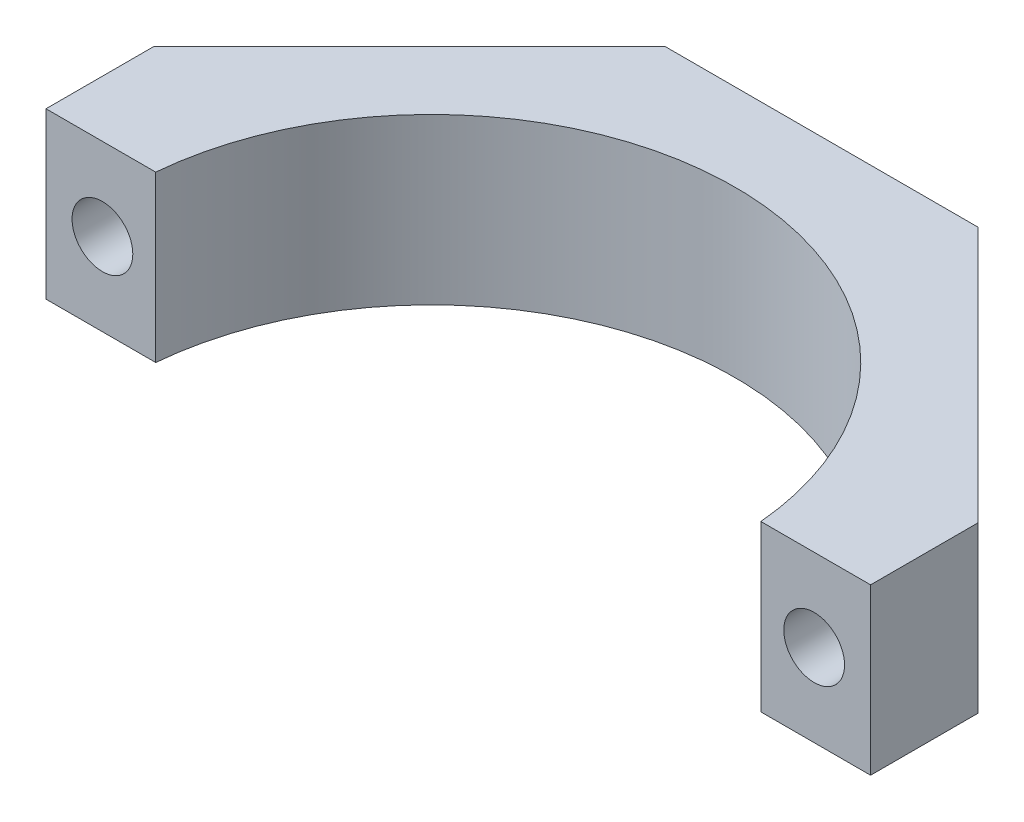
ISO-10303-21;
HEADER;
FILE_DESCRIPTION(('STEP AP214'),'2;1');
FILE_NAME('part.step','',(''),(''),'','','');
FILE_SCHEMA(('AUTOMOTIVE_DESIGN { 1 0 10303 214 1 1 1 1 }'));
ENDSEC;
DATA;
#1=APPLICATION_CONTEXT('core data for automotive mechanical design processes');
#2=APPLICATION_PROTOCOL_DEFINITION('international standard','automotive_design',2000,#1);
#3=PRODUCT_CONTEXT('',#1,'mechanical');
#4=PRODUCT('Part','Part','',(#3));
#5=PRODUCT_RELATED_PRODUCT_CATEGORY('part','',(#4));
#6=PRODUCT_DEFINITION_FORMATION('','',#4);
#7=PRODUCT_DEFINITION_CONTEXT('part definition',#1,'design');
#8=PRODUCT_DEFINITION('design','',#6,#7);
#9=PRODUCT_DEFINITION_SHAPE('','',#8);
#10=(LENGTH_UNIT() NAMED_UNIT(*) SI_UNIT(.MILLI.,.METRE.));
#11=(NAMED_UNIT(*) PLANE_ANGLE_UNIT() SI_UNIT($,.RADIAN.));
#12=(NAMED_UNIT(*) SI_UNIT($,.STERADIAN.) SOLID_ANGLE_UNIT());
#13=UNCERTAINTY_MEASURE_WITH_UNIT(LENGTH_MEASURE(1.E-05),#10,'distance_accuracy_value','');
#14=(GEOMETRIC_REPRESENTATION_CONTEXT(3) GLOBAL_UNCERTAINTY_ASSIGNED_CONTEXT((#13)) GLOBAL_UNIT_ASSIGNED_CONTEXT((#10,
#11,#12)) REPRESENTATION_CONTEXT('',''));
#15=CARTESIAN_POINT('',(0.,0.,0.));
#16=DIRECTION('',(0.,0.,1.));
#17=DIRECTION('',(1.,0.,0.));
#18=AXIS2_PLACEMENT_3D('',#15,#16,#17);
#19=CARTESIAN_POINT('',(24.13,9.652,0.));
#20=DIRECTION('',(0.,-1.,0.));
#21=DIRECTION('',(0.,0.,-1.));
#22=AXIS2_PLACEMENT_3D('',#19,#20,#21);
#23=CYLINDRICAL_SURFACE('',#22,17.78);
#24=DIRECTION('',(0.,-1.,0.));
#25=VECTOR('',#24,1.);
#26=CARTESIAN_POINT('',(6.4210123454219,9.652,-1.5875));
#27=LINE('',#26,#25);
#28=CARTESIAN_POINT('',(6.4210123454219,0.,-1.5875));
#29=VERTEX_POINT('',#28);
#30=CARTESIAN_POINT('',(6.4210123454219,9.652,-1.5875));
#31=VERTEX_POINT('',#30);
#32=EDGE_CURVE('E176',#29,#31,#27,.F.);
#33=ORIENTED_EDGE('',*,*,#32,.F.);
#34=CARTESIAN_POINT('',(24.13,0.,0.));
#35=DIRECTION('',(0.,-1.,0.));
#36=DIRECTION('',(0.,0.,1.));
#37=AXIS2_PLACEMENT_3D('',#34,#35,#36);
#38=CIRCLE('',#37,17.78);
#39=CARTESIAN_POINT('',(41.8389876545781,0.,-1.5875));
#40=VERTEX_POINT('',#39);
#41=EDGE_CURVE('E121',#29,#40,#38,.T.);
#42=ORIENTED_EDGE('',*,*,#41,.T.);
#43=DIRECTION('',(0.,-1.,0.));
#44=VECTOR('',#43,1.);
#45=CARTESIAN_POINT('',(41.8389876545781,9.652,-1.5875));
#46=LINE('',#45,#44);
#47=CARTESIAN_POINT('',(41.8389876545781,9.652,-1.5875));
#48=VERTEX_POINT('',#47);
#49=EDGE_CURVE('E50',#48,#40,#46,.T.);
#50=ORIENTED_EDGE('',*,*,#49,.F.);
#51=CARTESIAN_POINT('',(24.13,9.652,0.));
#52=DIRECTION('',(0.,-1.,0.));
#53=DIRECTION('',(0.,0.,1.));
#54=AXIS2_PLACEMENT_3D('',#51,#52,#53);
#55=CIRCLE('',#54,17.78);
#56=EDGE_CURVE('E135',#31,#48,#55,.T.);
#57=ORIENTED_EDGE('',*,*,#56,.F.);
#58=EDGE_LOOP('',(#33,#42,#50,#57));
#59=FACE_BOUND('',#58,.T.);
#60=ADVANCED_FACE('F34',(#59),#23,.F.);
#61=CARTESIAN_POINT('',(48.26,9.652,0.));
#62=DIRECTION('',(-1.,0.,0.));
#63=DIRECTION('',(0.,0.,1.));
#64=AXIS2_PLACEMENT_3D('',#61,#62,#63);
#65=PLANE('',#64);
#66=DIRECTION('',(0.,1.,0.));
#67=VECTOR('',#66,1.);
#68=CARTESIAN_POINT('',(48.26,9.652,-1.5875));
#69=LINE('',#68,#67);
#70=CARTESIAN_POINT('',(48.26,0.,-1.5875));
#71=VERTEX_POINT('',#70);
#72=CARTESIAN_POINT('',(48.26,9.652,-1.5875));
#73=VERTEX_POINT('',#72);
#74=EDGE_CURVE('E101',#71,#73,#69,.T.);
#75=ORIENTED_EDGE('',*,*,#74,.F.);
#76=DIRECTION('',(0.,0.,-1.));
#77=VECTOR('',#76,1.);
#78=CARTESIAN_POINT('',(48.26,0.,0.));
#79=LINE('',#78,#77);
#80=CARTESIAN_POINT('',(48.26,0.,-7.87400000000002));
#81=VERTEX_POINT('',#80);
#82=EDGE_CURVE('E114',#71,#81,#79,.T.);
#83=ORIENTED_EDGE('',*,*,#82,.T.);
#84=DIRECTION('',(0.,-1.,0.));
#85=VECTOR('',#84,1.);
#86=CARTESIAN_POINT('',(48.26,9.652,-7.87400000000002));
#87=LINE('',#86,#85);
#88=CARTESIAN_POINT('',(48.26,9.652,-7.87400000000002));
#89=VERTEX_POINT('',#88);
#90=EDGE_CURVE('E11',#89,#81,#87,.T.);
#91=ORIENTED_EDGE('',*,*,#90,.F.);
#92=DIRECTION('',(0.,0.,-1.));
#93=VECTOR('',#92,1.);
#94=CARTESIAN_POINT('',(48.26,9.652,0.));
#95=LINE('',#94,#93);
#96=EDGE_CURVE('E115',#73,#89,#95,.T.);
#97=ORIENTED_EDGE('',*,*,#96,.F.);
#98=EDGE_LOOP('',(#75,#83,#91,#97));
#99=FACE_BOUND('',#98,.T.);
#100=ADVANCED_FACE('F112',(#99),#65,.F.);
#101=CARTESIAN_POINT('',(0.,9.652,0.));
#102=DIRECTION('',(1.,0.,0.));
#103=DIRECTION('',(0.,0.,-1.));
#104=AXIS2_PLACEMENT_3D('',#101,#102,#103);
#105=PLANE('',#104);
#106=DIRECTION('',(0.,-1.,0.));
#107=VECTOR('',#106,1.);
#108=CARTESIAN_POINT('',(0.,9.652,-1.5875));
#109=LINE('',#108,#107);
#110=CARTESIAN_POINT('',(0.,9.652,-1.5875));
#111=VERTEX_POINT('',#110);
#112=CARTESIAN_POINT('',(0.,0.,-1.5875));
#113=VERTEX_POINT('',#112);
#114=EDGE_CURVE('E58',#111,#113,#109,.T.);
#115=ORIENTED_EDGE('',*,*,#114,.F.);
#116=DIRECTION('',(0.,0.,1.));
#117=VECTOR('',#116,1.);
#118=CARTESIAN_POINT('',(0.,9.652,0.));
#119=LINE('',#118,#117);
#120=CARTESIAN_POINT('',(0.,9.652,-7.874));
#121=VERTEX_POINT('',#120);
#122=EDGE_CURVE('E145',#121,#111,#119,.T.);
#123=ORIENTED_EDGE('',*,*,#122,.F.);
#124=DIRECTION('',(0.,-1.,0.));
#125=VECTOR('',#124,1.);
#126=CARTESIAN_POINT('',(0.,9.652,-7.874));
#127=LINE('',#126,#125);
#128=CARTESIAN_POINT('',(0.,0.,-7.874));
#129=VERTEX_POINT('',#128);
#130=EDGE_CURVE('E148',#121,#129,#127,.T.);
#131=ORIENTED_EDGE('',*,*,#130,.T.);
#132=DIRECTION('',(0.,0.,1.));
#133=VECTOR('',#132,1.);
#134=CARTESIAN_POINT('',(0.,0.,0.));
#135=LINE('',#134,#133);
#136=EDGE_CURVE('E132',#129,#113,#135,.T.);
#137=ORIENTED_EDGE('',*,*,#136,.T.);
#138=EDGE_LOOP('',(#115,#123,#131,#137));
#139=FACE_BOUND('',#138,.T.);
#140=ADVANCED_FACE('F208',(#139),#105,.F.);
#141=CARTESIAN_POINT('',(24.13,9.652,0.));
#142=DIRECTION('',(0.,1.,0.));
#143=DIRECTION('',(0.,0.,1.));
#144=AXIS2_PLACEMENT_3D('',#141,#142,#143);
#145=PLANE('',#144);
#146=ORIENTED_EDGE('',*,*,#122,.T.);
#147=DIRECTION('',(1.,0.,0.));
#148=VECTOR('',#147,1.);
#149=CARTESIAN_POINT('',(24.13,9.652,-1.5875));
#150=LINE('',#149,#148);
#151=EDGE_CURVE('E175',#111,#31,#150,.T.);
#152=ORIENTED_EDGE('',*,*,#151,.T.);
#153=ORIENTED_EDGE('',*,*,#56,.T.);
#154=EDGE_CURVE('E179',#48,#73,#150,.T.);
#155=ORIENTED_EDGE('',*,*,#154,.T.);
#156=ORIENTED_EDGE('',*,*,#96,.T.);
#157=DIRECTION('',(-0.707106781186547,0.,-0.707106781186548));
#158=VECTOR('',#157,1.);
#159=CARTESIAN_POINT('',(33.274,9.652,-22.86));
#160=LINE('',#159,#158);
#161=CARTESIAN_POINT('',(33.274,9.652,-22.86));
#162=VERTEX_POINT('',#161);
#163=EDGE_CURVE('E139',#89,#162,#160,.T.);
#164=ORIENTED_EDGE('',*,*,#163,.T.);
#165=DIRECTION('',(-1.,0.,0.));
#166=VECTOR('',#165,1.);
#167=CARTESIAN_POINT('',(33.274,9.652,-22.86));
#168=LINE('',#167,#166);
#169=CARTESIAN_POINT('',(14.986,9.652,-22.86));
#170=VERTEX_POINT('',#169);
#171=EDGE_CURVE('E141',#162,#170,#168,.T.);
#172=ORIENTED_EDGE('',*,*,#171,.T.);
#173=DIRECTION('',(-0.707106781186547,0.,0.707106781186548));
#174=VECTOR('',#173,1.);
#175=CARTESIAN_POINT('',(14.986,9.652,-22.86));
#176=LINE('',#175,#174);
#177=EDGE_CURVE('E143',#170,#121,#176,.T.);
#178=ORIENTED_EDGE('',*,*,#177,.T.);
#179=EDGE_LOOP('',(#146,#152,#153,#155,#156,#164,#172,#178));
#180=FACE_BOUND('',#179,.T.);
#181=ADVANCED_FACE('F227',(#180),#145,.T.);
#182=CARTESIAN_POINT('',(24.13,0.,0.));
#183=DIRECTION('',(0.,1.,0.));
#184=DIRECTION('',(0.,0.,1.));
#185=AXIS2_PLACEMENT_3D('',#182,#183,#184);
#186=PLANE('',#185);
#187=DIRECTION('',(1.,0.,0.));
#188=VECTOR('',#187,1.);
#189=CARTESIAN_POINT('',(24.13,0.,-1.5875));
#190=LINE('',#189,#188);
#191=EDGE_CURVE('E109',#113,#29,#190,.T.);
#192=ORIENTED_EDGE('',*,*,#191,.F.);
#193=ORIENTED_EDGE('',*,*,#136,.F.);
#194=DIRECTION('',(-0.707106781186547,0.,0.707106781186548));
#195=VECTOR('',#194,1.);
#196=CARTESIAN_POINT('',(14.986,0.,-22.86));
#197=LINE('',#196,#195);
#198=CARTESIAN_POINT('',(14.986,0.,-22.86));
#199=VERTEX_POINT('',#198);
#200=EDGE_CURVE('E130',#199,#129,#197,.T.);
#201=ORIENTED_EDGE('',*,*,#200,.F.);
#202=DIRECTION('',(-1.,0.,0.));
#203=VECTOR('',#202,1.);
#204=CARTESIAN_POINT('',(33.274,0.,-22.86));
#205=LINE('',#204,#203);
#206=CARTESIAN_POINT('',(33.274,0.,-22.86));
#207=VERTEX_POINT('',#206);
#208=EDGE_CURVE('E123',#207,#199,#205,.T.);
#209=ORIENTED_EDGE('',*,*,#208,.F.);
#210=DIRECTION('',(-0.707106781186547,0.,-0.707106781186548));
#211=VECTOR('',#210,1.);
#212=CARTESIAN_POINT('',(33.274,0.,-22.86));
#213=LINE('',#212,#211);
#214=EDGE_CURVE('E120',#81,#207,#213,.T.);
#215=ORIENTED_EDGE('',*,*,#214,.F.);
#216=ORIENTED_EDGE('',*,*,#82,.F.);
#217=EDGE_CURVE('E97',#40,#71,#190,.T.);
#218=ORIENTED_EDGE('',*,*,#217,.F.);
#219=ORIENTED_EDGE('',*,*,#41,.F.);
#220=EDGE_LOOP('',(#192,#193,#201,#209,#215,#216,#218,#219));
#221=FACE_BOUND('',#220,.T.);
#222=ADVANCED_FACE('F118',(#221),#186,.F.);
#223=CARTESIAN_POINT('',(3.302,4.826,-22.86));
#224=DIRECTION('',(0.,0.,1.));
#225=DIRECTION('',(1.,0.,0.));
#226=AXIS2_PLACEMENT_3D('',#223,#224,#225);
#227=CYLINDRICAL_SURFACE('',#226,1.778);
#228=CARTESIAN_POINT('',(3.302,4.826,-7.874));
#229=DIRECTION('',(0.,0.,1.));
#230=DIRECTION('',(1.,0.,0.));
#231=AXIS2_PLACEMENT_3D('',#228,#229,#230);
#232=CIRCLE('',#231,1.778);
#233=CARTESIAN_POINT('',(5.08,4.826,-7.874));
#234=VERTEX_POINT('',#233);
#235=EDGE_CURVE('E156',#234,#234,#232,.F.);
#236=CARTESIAN_POINT('',(3.302,4.826,-1.5875));
#237=DIRECTION('',(0.,0.,1.));
#238=DIRECTION('',(1.,0.,0.));
#239=AXIS2_PLACEMENT_3D('',#236,#237,#238);
#240=CIRCLE('',#239,1.778);
#241=CARTESIAN_POINT('',(5.08,4.826,-1.5875));
#242=VERTEX_POINT('',#241);
#243=EDGE_CURVE('E107',#242,#242,#240,.F.);
#244=CARTESIAN_POINT('',(5.08,4.826,-7.874));
#245=CARTESIAN_POINT('',(5.08,4.826,-7.808515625));
#246=CARTESIAN_POINT('',(5.08,4.826,-7.74303125));
#247=CARTESIAN_POINT('',(5.08,4.826,-7.6120625));
#248=CARTESIAN_POINT('',(5.08,4.826,-7.546578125));
#249=CARTESIAN_POINT('',(5.08,4.826,-7.415609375));
#250=CARTESIAN_POINT('',(5.08,4.826,-7.350125));
#251=CARTESIAN_POINT('',(5.08,4.826,-7.21915625));
#252=CARTESIAN_POINT('',(5.08,4.826,-7.153671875));
#253=CARTESIAN_POINT('',(5.08,4.826,-7.022703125));
#254=CARTESIAN_POINT('',(5.08,4.826,-6.95721875));
#255=CARTESIAN_POINT('',(5.08,4.826,-6.82625));
#256=CARTESIAN_POINT('',(5.08,4.826,-6.760765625));
#257=CARTESIAN_POINT('',(5.08,4.826,-6.629796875));
#258=CARTESIAN_POINT('',(5.08,4.826,-6.5643125));
#259=CARTESIAN_POINT('',(5.08,4.826,-6.43334375));
#260=CARTESIAN_POINT('',(5.08,4.826,-6.367859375));
#261=CARTESIAN_POINT('',(5.08,4.826,-6.236890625));
#262=CARTESIAN_POINT('',(5.08,4.826,-6.17140625));
#263=CARTESIAN_POINT('',(5.08,4.826,-6.0404375));
#264=CARTESIAN_POINT('',(5.08,4.826,-5.974953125));
#265=CARTESIAN_POINT('',(5.08,4.826,-5.843984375));
#266=CARTESIAN_POINT('',(5.08,4.826,-5.7785));
#267=CARTESIAN_POINT('',(5.08,4.826,-5.64753125));
#268=CARTESIAN_POINT('',(5.08,4.826,-5.582046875));
#269=CARTESIAN_POINT('',(5.08,4.826,-5.451078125));
#270=CARTESIAN_POINT('',(5.08,4.826,-5.38559375));
#271=CARTESIAN_POINT('',(5.08,4.826,-5.254625));
#272=CARTESIAN_POINT('',(5.08,4.826,-5.189140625));
#273=CARTESIAN_POINT('',(5.08,4.826,-5.058171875));
#274=CARTESIAN_POINT('',(5.08,4.826,-4.9926875));
#275=CARTESIAN_POINT('',(5.08,4.826,-4.86171875));
#276=CARTESIAN_POINT('',(5.08,4.826,-4.796234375));
#277=CARTESIAN_POINT('',(5.08,4.826,-4.665265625));
#278=CARTESIAN_POINT('',(5.08,4.826,-4.59978125));
#279=CARTESIAN_POINT('',(5.08,4.826,-4.4688125));
#280=CARTESIAN_POINT('',(5.08,4.826,-4.403328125));
#281=CARTESIAN_POINT('',(5.08,4.826,-4.272359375));
#282=CARTESIAN_POINT('',(5.08,4.826,-4.206875));
#283=CARTESIAN_POINT('',(5.08,4.826,-4.07590625));
#284=CARTESIAN_POINT('',(5.08,4.826,-4.010421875));
#285=CARTESIAN_POINT('',(5.08,4.826,-3.879453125));
#286=CARTESIAN_POINT('',(5.08,4.826,-3.81396875));
#287=CARTESIAN_POINT('',(5.08,4.826,-3.683));
#288=CARTESIAN_POINT('',(5.08,4.826,-3.617515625));
#289=CARTESIAN_POINT('',(5.08,4.826,-3.486546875));
#290=CARTESIAN_POINT('',(5.08,4.826,-3.4210625));
#291=CARTESIAN_POINT('',(5.08,4.826,-3.29009375));
#292=CARTESIAN_POINT('',(5.08,4.826,-3.224609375));
#293=CARTESIAN_POINT('',(5.08,4.826,-3.093640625));
#294=CARTESIAN_POINT('',(5.08,4.826,-3.02815625));
#295=CARTESIAN_POINT('',(5.08,4.826,-2.8971875));
#296=CARTESIAN_POINT('',(5.08,4.826,-2.831703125));
#297=CARTESIAN_POINT('',(5.08,4.826,-2.700734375));
#298=CARTESIAN_POINT('',(5.08,4.826,-2.63525));
#299=CARTESIAN_POINT('',(5.08,4.826,-2.50428125));
#300=CARTESIAN_POINT('',(5.08,4.826,-2.438796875));
#301=CARTESIAN_POINT('',(5.08,4.826,-2.307828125));
#302=CARTESIAN_POINT('',(5.08,4.826,-2.24234375));
#303=CARTESIAN_POINT('',(5.08,4.826,-2.111375));
#304=CARTESIAN_POINT('',(5.08,4.826,-2.045890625));
#305=CARTESIAN_POINT('',(5.08,4.826,-1.914921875));
#306=CARTESIAN_POINT('',(5.08,4.826,-1.8494375));
#307=CARTESIAN_POINT('',(5.08,4.826,-1.71846875));
#308=CARTESIAN_POINT('',(5.08,4.826,-1.652984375));
#309=CARTESIAN_POINT('',(5.08,4.826,-1.5875));
#310=B_SPLINE_CURVE_WITH_KNOTS('',3,(#244,#245,#246,#247,#248,#249,#250,#251,#252,#253,#254,
#255,#256,#257,#258,#259,#260,#261,#262,#263,#264,#265,#266,#267,#268,#269,#270,#271,#272,#273,
#274,#275,#276,#277,#278,#279,#280,#281,#282,#283,#284,#285,#286,#287,#288,#289,#290,#291,#292,
#293,#294,#295,#296,#297,#298,#299,#300,#301,#302,#303,#304,#305,#306,#307,#308,#309),
.UNSPECIFIED.,.F.,.F.,(4,2,2,2,2,2,2,2,2,2,2,2,2,2,2,2,2,2,2,2,2,2,2,2,2,2,2,2,2,2,2,2,4),(0.,
0.196453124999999,0.39290625,0.589359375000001,0.785812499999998,0.982265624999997,1.17871875,
1.375171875,1.571625,1.768078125,1.96453125,2.160984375,2.3574375,2.553890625,2.75034375,
2.946796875,3.14325,3.339703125,3.53615625,3.732609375,3.9290625,4.125515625,4.32196875,
4.518421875,4.714875,4.911328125,5.10778125,5.304234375,5.5006875,5.697140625,5.89359375,
6.090046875,6.2865),.UNSPECIFIED.);
#311=EDGE_CURVE('BSEAM191',#234,#242,#310,.T.);
#312=ORIENTED_EDGE('',*,*,#235,.T.);
#313=ORIENTED_EDGE('',*,*,#243,.F.);
#314=ORIENTED_EDGE('',*,*,#311,.T.);
#315=ORIENTED_EDGE('',*,*,#311,.F.);
#316=EDGE_LOOP('',(#312,#314,#313,#315));
#317=FACE_BOUND('',#316,.T.);
#318=ADVANCED_FACE('F191',(#317),#227,.F.);
#319=CARTESIAN_POINT('',(44.958,4.826,-22.86));
#320=DIRECTION('',(0.,0.,1.));
#321=DIRECTION('',(1.,0.,0.));
#322=AXIS2_PLACEMENT_3D('',#319,#320,#321);
#323=CYLINDRICAL_SURFACE('',#322,1.778);
#324=CARTESIAN_POINT('',(44.958,4.826,-7.874));
#325=DIRECTION('',(0.,0.,1.));
#326=DIRECTION('',(1.,0.,0.));
#327=AXIS2_PLACEMENT_3D('',#324,#325,#326);
#328=CIRCLE('',#327,1.778);
#329=CARTESIAN_POINT('',(46.736,4.826,-7.874));
#330=VERTEX_POINT('',#329);
#331=EDGE_CURVE('E162',#330,#330,#328,.F.);
#332=CARTESIAN_POINT('',(44.958,4.826,-1.5875));
#333=DIRECTION('',(0.,0.,1.));
#334=DIRECTION('',(1.,0.,0.));
#335=AXIS2_PLACEMENT_3D('',#332,#333,#334);
#336=CIRCLE('',#335,1.778);
#337=CARTESIAN_POINT('',(46.736,4.826,-1.5875));
#338=VERTEX_POINT('',#337);
#339=EDGE_CURVE('E37',#338,#338,#336,.F.);
#340=CARTESIAN_POINT('',(46.736,4.826,-7.874));
#341=CARTESIAN_POINT('',(46.736,4.826,-7.808515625));
#342=CARTESIAN_POINT('',(46.736,4.826,-7.74303125));
#343=CARTESIAN_POINT('',(46.736,4.826,-7.6120625));
#344=CARTESIAN_POINT('',(46.736,4.826,-7.546578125));
#345=CARTESIAN_POINT('',(46.736,4.826,-7.415609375));
#346=CARTESIAN_POINT('',(46.736,4.826,-7.350125));
#347=CARTESIAN_POINT('',(46.736,4.826,-7.21915625));
#348=CARTESIAN_POINT('',(46.736,4.826,-7.153671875));
#349=CARTESIAN_POINT('',(46.736,4.826,-7.022703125));
#350=CARTESIAN_POINT('',(46.736,4.826,-6.95721875));
#351=CARTESIAN_POINT('',(46.736,4.826,-6.82625));
#352=CARTESIAN_POINT('',(46.736,4.826,-6.760765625));
#353=CARTESIAN_POINT('',(46.736,4.826,-6.629796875));
#354=CARTESIAN_POINT('',(46.736,4.826,-6.5643125));
#355=CARTESIAN_POINT('',(46.736,4.826,-6.43334375));
#356=CARTESIAN_POINT('',(46.736,4.826,-6.367859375));
#357=CARTESIAN_POINT('',(46.736,4.826,-6.236890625));
#358=CARTESIAN_POINT('',(46.736,4.826,-6.17140625));
#359=CARTESIAN_POINT('',(46.736,4.826,-6.0404375));
#360=CARTESIAN_POINT('',(46.736,4.826,-5.974953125));
#361=CARTESIAN_POINT('',(46.736,4.826,-5.843984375));
#362=CARTESIAN_POINT('',(46.736,4.826,-5.7785));
#363=CARTESIAN_POINT('',(46.736,4.826,-5.64753125));
#364=CARTESIAN_POINT('',(46.736,4.826,-5.582046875));
#365=CARTESIAN_POINT('',(46.736,4.826,-5.451078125));
#366=CARTESIAN_POINT('',(46.736,4.826,-5.38559375));
#367=CARTESIAN_POINT('',(46.736,4.826,-5.254625));
#368=CARTESIAN_POINT('',(46.736,4.826,-5.189140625));
#369=CARTESIAN_POINT('',(46.736,4.826,-5.058171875));
#370=CARTESIAN_POINT('',(46.736,4.826,-4.9926875));
#371=CARTESIAN_POINT('',(46.736,4.826,-4.86171875));
#372=CARTESIAN_POINT('',(46.736,4.826,-4.796234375));
#373=CARTESIAN_POINT('',(46.736,4.826,-4.665265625));
#374=CARTESIAN_POINT('',(46.736,4.826,-4.59978125));
#375=CARTESIAN_POINT('',(46.736,4.826,-4.4688125));
#376=CARTESIAN_POINT('',(46.736,4.826,-4.403328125));
#377=CARTESIAN_POINT('',(46.736,4.826,-4.272359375));
#378=CARTESIAN_POINT('',(46.736,4.826,-4.206875));
#379=CARTESIAN_POINT('',(46.736,4.826,-4.07590625));
#380=CARTESIAN_POINT('',(46.736,4.826,-4.010421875));
#381=CARTESIAN_POINT('',(46.736,4.826,-3.879453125));
#382=CARTESIAN_POINT('',(46.736,4.826,-3.81396875));
#383=CARTESIAN_POINT('',(46.736,4.826,-3.683));
#384=CARTESIAN_POINT('',(46.736,4.826,-3.617515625));
#385=CARTESIAN_POINT('',(46.736,4.826,-3.486546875));
#386=CARTESIAN_POINT('',(46.736,4.826,-3.4210625));
#387=CARTESIAN_POINT('',(46.736,4.826,-3.29009375));
#388=CARTESIAN_POINT('',(46.736,4.826,-3.224609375));
#389=CARTESIAN_POINT('',(46.736,4.826,-3.093640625));
#390=CARTESIAN_POINT('',(46.736,4.826,-3.02815625));
#391=CARTESIAN_POINT('',(46.736,4.826,-2.8971875));
#392=CARTESIAN_POINT('',(46.736,4.826,-2.831703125));
#393=CARTESIAN_POINT('',(46.736,4.826,-2.700734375));
#394=CARTESIAN_POINT('',(46.736,4.826,-2.63525));
#395=CARTESIAN_POINT('',(46.736,4.826,-2.50428125));
#396=CARTESIAN_POINT('',(46.736,4.826,-2.438796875));
#397=CARTESIAN_POINT('',(46.736,4.826,-2.307828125));
#398=CARTESIAN_POINT('',(46.736,4.826,-2.24234375));
#399=CARTESIAN_POINT('',(46.736,4.826,-2.111375));
#400=CARTESIAN_POINT('',(46.736,4.826,-2.045890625));
#401=CARTESIAN_POINT('',(46.736,4.826,-1.914921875));
#402=CARTESIAN_POINT('',(46.736,4.826,-1.8494375));
#403=CARTESIAN_POINT('',(46.736,4.826,-1.71846875));
#404=CARTESIAN_POINT('',(46.736,4.826,-1.652984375));
#405=CARTESIAN_POINT('',(46.736,4.826,-1.5875));
#406=B_SPLINE_CURVE_WITH_KNOTS('',3,(#340,#341,#342,#343,#344,#345,#346,#347,#348,#349,#350,
#351,#352,#353,#354,#355,#356,#357,#358,#359,#360,#361,#362,#363,#364,#365,#366,#367,#368,#369,
#370,#371,#372,#373,#374,#375,#376,#377,#378,#379,#380,#381,#382,#383,#384,#385,#386,#387,#388,
#389,#390,#391,#392,#393,#394,#395,#396,#397,#398,#399,#400,#401,#402,#403,#404,#405),
.UNSPECIFIED.,.F.,.F.,(4,2,2,2,2,2,2,2,2,2,2,2,2,2,2,2,2,2,2,2,2,2,2,2,2,2,2,2,2,2,2,2,4),(0.,
0.196453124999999,0.39290625,0.589359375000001,0.785812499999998,0.982265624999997,1.17871875,
1.375171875,1.571625,1.768078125,1.96453125,2.160984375,2.3574375,2.553890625,2.75034375,
2.946796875,3.14325,3.339703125,3.53615625,3.732609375,3.9290625,4.125515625,4.32196875,
4.518421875,4.714875,4.911328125,5.10778125,5.304234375,5.5006875,5.697140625,5.89359375,
6.090046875,6.2865),.UNSPECIFIED.);
#407=EDGE_CURVE('BSEAM188',#330,#338,#406,.T.);
#408=ORIENTED_EDGE('',*,*,#331,.T.);
#409=ORIENTED_EDGE('',*,*,#339,.F.);
#410=ORIENTED_EDGE('',*,*,#407,.T.);
#411=ORIENTED_EDGE('',*,*,#407,.F.);
#412=EDGE_LOOP('',(#408,#410,#409,#411));
#413=FACE_BOUND('',#412,.T.);
#414=ADVANCED_FACE('F188',(#413),#323,.F.);
#415=CARTESIAN_POINT('',(33.274,9.652,-22.86));
#416=DIRECTION('',(-0.707106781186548,0.,0.707106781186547));
#417=DIRECTION('',(0.707106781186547,0.,0.707106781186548));
#418=AXIS2_PLACEMENT_3D('',#415,#416,#417);
#419=PLANE('',#418);
#420=CARTESIAN_POINT('',(44.958,4.826,-11.176));
#421=DIRECTION('',(-0.707106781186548,0.,0.707106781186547));
#422=DIRECTION('',(0.707106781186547,0.,0.707106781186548));
#423=AXIS2_PLACEMENT_3D('',#420,#421,#422);
#424=ELLIPSE('',#423,4.49012806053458,3.175);
#425=CARTESIAN_POINT('',(48.133,4.826,-8.00100000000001));
#426=VERTEX_POINT('',#425);
#427=EDGE_CURVE('E164',#426,#426,#424,.T.);
#428=ORIENTED_EDGE('',*,*,#427,.T.);
#429=EDGE_LOOP('',(#428));
#430=FACE_BOUND('',#429,.T.);
#431=ORIENTED_EDGE('',*,*,#214,.T.);
#432=DIRECTION('',(0.,-1.,0.));
#433=VECTOR('',#432,1.);
#434=CARTESIAN_POINT('',(33.274,9.652,-22.86));
#435=LINE('',#434,#433);
#436=EDGE_CURVE('E42',#162,#207,#435,.T.);
#437=ORIENTED_EDGE('',*,*,#436,.F.);
#438=ORIENTED_EDGE('',*,*,#163,.F.);
#439=ORIENTED_EDGE('',*,*,#90,.T.);
#440=EDGE_LOOP('',(#431,#437,#438,#439));
#441=FACE_BOUND('',#440,.T.);
#442=ADVANCED_FACE('F190',(#430,#441),#419,.F.);
#443=CARTESIAN_POINT('',(33.274,9.652,-22.86));
#444=DIRECTION('',(0.,0.,1.));
#445=DIRECTION('',(1.,0.,0.));
#446=AXIS2_PLACEMENT_3D('',#443,#444,#445);
#447=PLANE('',#446);
#448=ORIENTED_EDGE('',*,*,#208,.T.);
#449=DIRECTION('',(0.,-1.,0.));
#450=VECTOR('',#449,1.);
#451=CARTESIAN_POINT('',(14.986,9.652,-22.86));
#452=LINE('',#451,#450);
#453=EDGE_CURVE('E151',#170,#199,#452,.T.);
#454=ORIENTED_EDGE('',*,*,#453,.F.);
#455=ORIENTED_EDGE('',*,*,#171,.F.);
#456=ORIENTED_EDGE('',*,*,#436,.T.);
#457=EDGE_LOOP('',(#448,#454,#455,#456));
#458=FACE_BOUND('',#457,.T.);
#459=ADVANCED_FACE('F198',(#458),#447,.F.);
#460=CARTESIAN_POINT('',(14.986,9.652,-22.86));
#461=DIRECTION('',(0.707106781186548,0.,0.707106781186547));
#462=DIRECTION('',(0.707106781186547,0.,-0.707106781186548));
#463=AXIS2_PLACEMENT_3D('',#460,#461,#462);
#464=PLANE('',#463);
#465=CARTESIAN_POINT('',(3.302,4.826,-11.176));
#466=DIRECTION('',(0.707106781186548,0.,0.707106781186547));
#467=DIRECTION('',(-0.707106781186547,0.,0.707106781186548));
#468=AXIS2_PLACEMENT_3D('',#465,#466,#467);
#469=ELLIPSE('',#468,4.49012806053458,3.175);
#470=CARTESIAN_POINT('',(0.126999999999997,4.826,-8.001));
#471=VERTEX_POINT('',#470);
#472=EDGE_CURVE('E125',#471,#471,#469,.T.);
#473=ORIENTED_EDGE('',*,*,#472,.T.);
#474=EDGE_LOOP('',(#473));
#475=FACE_BOUND('',#474,.T.);
#476=ORIENTED_EDGE('',*,*,#200,.T.);
#477=ORIENTED_EDGE('',*,*,#130,.F.);
#478=ORIENTED_EDGE('',*,*,#177,.F.);
#479=ORIENTED_EDGE('',*,*,#453,.T.);
#480=EDGE_LOOP('',(#476,#477,#478,#479));
#481=FACE_BOUND('',#480,.T.);
#482=ADVANCED_FACE('F219',(#475,#481),#464,.F.);
#483=CARTESIAN_POINT('',(3.302,4.826,-22.86));
#484=DIRECTION('',(0.,0.,1.));
#485=DIRECTION('',(1.,0.,0.));
#486=AXIS2_PLACEMENT_3D('',#483,#484,#485);
#487=CYLINDRICAL_SURFACE('',#486,3.175);
#488=CARTESIAN_POINT('',(3.302,4.826,-7.874));
#489=DIRECTION('',(0.,0.,1.));
#490=DIRECTION('',(1.,0.,0.));
#491=AXIS2_PLACEMENT_3D('',#488,#489,#490);
#492=CIRCLE('',#491,3.175);
#493=CARTESIAN_POINT('',(6.477,4.826,-7.874));
#494=VERTEX_POINT('',#493);
#495=EDGE_CURVE('E159',#494,#494,#492,.T.);
#496=ORIENTED_EDGE('',*,*,#495,.T.);
#497=EDGE_LOOP('',(#496));
#498=FACE_BOUND('',#497,.T.);
#499=ORIENTED_EDGE('',*,*,#472,.F.);
#500=EDGE_LOOP('',(#499));
#501=FACE_BOUND('',#500,.T.);
#502=ADVANCED_FACE('F245',(#498,#501),#487,.F.);
#503=CARTESIAN_POINT('',(3.302,4.826,-7.874));
#504=DIRECTION('',(0.,0.,1.));
#505=DIRECTION('',(1.,0.,0.));
#506=AXIS2_PLACEMENT_3D('',#503,#504,#505);
#507=PLANE('',#506);
#508=ORIENTED_EDGE('',*,*,#495,.F.);
#509=EDGE_LOOP('',(#508));
#510=FACE_BOUND('',#509,.T.);
#511=ORIENTED_EDGE('',*,*,#235,.F.);
#512=EDGE_LOOP('',(#511));
#513=FACE_BOUND('',#512,.T.);
#514=ADVANCED_FACE('F242',(#510,#513),#507,.F.);
#515=CARTESIAN_POINT('',(44.958,4.826,-22.86));
#516=DIRECTION('',(0.,0.,1.));
#517=DIRECTION('',(1.,0.,0.));
#518=AXIS2_PLACEMENT_3D('',#515,#516,#517);
#519=CYLINDRICAL_SURFACE('',#518,3.175);
#520=CARTESIAN_POINT('',(44.958,4.826,-7.874));
#521=DIRECTION('',(0.,0.,1.));
#522=DIRECTION('',(1.,0.,0.));
#523=AXIS2_PLACEMENT_3D('',#520,#521,#522);
#524=CIRCLE('',#523,3.175);
#525=CARTESIAN_POINT('',(48.133,4.826,-7.874));
#526=VERTEX_POINT('',#525);
#527=EDGE_CURVE('E165',#526,#526,#524,.T.);
#528=ORIENTED_EDGE('',*,*,#527,.T.);
#529=EDGE_LOOP('',(#528));
#530=FACE_BOUND('',#529,.T.);
#531=ORIENTED_EDGE('',*,*,#427,.F.);
#532=EDGE_LOOP('',(#531));
#533=FACE_BOUND('',#532,.T.);
#534=ADVANCED_FACE('F238',(#530,#533),#519,.F.);
#535=CARTESIAN_POINT('',(44.958,4.826,-7.874));
#536=DIRECTION('',(0.,0.,1.));
#537=DIRECTION('',(1.,0.,0.));
#538=AXIS2_PLACEMENT_3D('',#535,#536,#537);
#539=PLANE('',#538);
#540=ORIENTED_EDGE('',*,*,#527,.F.);
#541=EDGE_LOOP('',(#540));
#542=FACE_BOUND('',#541,.T.);
#543=ORIENTED_EDGE('',*,*,#331,.F.);
#544=EDGE_LOOP('',(#543));
#545=FACE_BOUND('',#544,.T.);
#546=ADVANCED_FACE('F234',(#542,#545),#539,.F.);
#547=CARTESIAN_POINT('',(-1.18662331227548,-4.02136776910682,-1.5875));
#548=DIRECTION('',(0.,0.,1.));
#549=DIRECTION('',(1.,0.,0.));
#550=AXIS2_PLACEMENT_3D('',#547,#548,#549);
#551=PLANE('',#550);
#552=ORIENTED_EDGE('',*,*,#49,.T.);
#553=ORIENTED_EDGE('',*,*,#217,.T.);
#554=ORIENTED_EDGE('',*,*,#74,.T.);
#555=ORIENTED_EDGE('',*,*,#154,.F.);
#556=EDGE_LOOP('',(#552,#553,#554,#555));
#557=FACE_BOUND('',#556,.T.);
#558=ORIENTED_EDGE('',*,*,#339,.T.);
#559=EDGE_LOOP('',(#558));
#560=FACE_BOUND('',#559,.T.);
#561=ADVANCED_FACE('F99',(#557,#560),#551,.T.);
#562=ORIENTED_EDGE('',*,*,#114,.T.);
#563=ORIENTED_EDGE('',*,*,#191,.T.);
#564=ORIENTED_EDGE('',*,*,#32,.T.);
#565=ORIENTED_EDGE('',*,*,#151,.F.);
#566=EDGE_LOOP('',(#562,#563,#564,#565));
#567=FACE_BOUND('',#566,.T.);
#568=ORIENTED_EDGE('',*,*,#243,.T.);
#569=EDGE_LOOP('',(#568));
#570=FACE_BOUND('',#569,.T.);
#571=ADVANCED_FACE('F228',(#567,#570),#551,.T.);
#572=CLOSED_SHELL('',(#60,#100,#140,#181,#222,#318,#414,#442,#459,#482,#502,#514,#534,#546,#561,#571));
#573=MANIFOLD_SOLID_BREP('B2',#572);
#574=ADVANCED_BREP_SHAPE_REPRESENTATION('',(#18,#573),#14);
#575=SHAPE_DEFINITION_REPRESENTATION(#9,#574);
ENDSEC;
END-ISO-10303-21;
